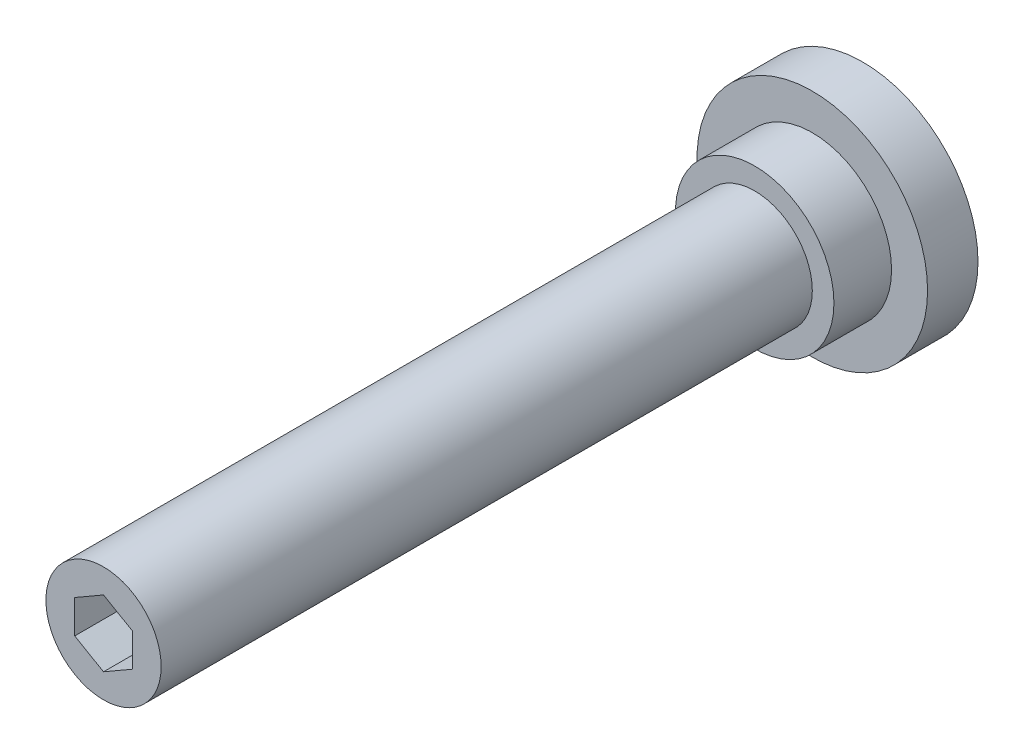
ISO-10303-21;
HEADER;
FILE_DESCRIPTION(('STEP AP214'),'2;1');
FILE_NAME('part.step','',(''),(''),'','','');
FILE_SCHEMA(('AUTOMOTIVE_DESIGN { 1 0 10303 214 1 1 1 1 }'));
ENDSEC;
DATA;
#1=APPLICATION_CONTEXT('core data for automotive mechanical design processes');
#2=APPLICATION_PROTOCOL_DEFINITION('international standard','automotive_design',2000,#1);
#3=PRODUCT_CONTEXT('',#1,'mechanical');
#4=PRODUCT('Part','Part','',(#3));
#5=PRODUCT_RELATED_PRODUCT_CATEGORY('part','',(#4));
#6=PRODUCT_DEFINITION_FORMATION('','',#4);
#7=PRODUCT_DEFINITION_CONTEXT('part definition',#1,'design');
#8=PRODUCT_DEFINITION('design','',#6,#7);
#9=PRODUCT_DEFINITION_SHAPE('','',#8);
#10=(LENGTH_UNIT() NAMED_UNIT(*) SI_UNIT(.MILLI.,.METRE.));
#11=(NAMED_UNIT(*) PLANE_ANGLE_UNIT() SI_UNIT($,.RADIAN.));
#12=(NAMED_UNIT(*) SI_UNIT($,.STERADIAN.) SOLID_ANGLE_UNIT());
#13=UNCERTAINTY_MEASURE_WITH_UNIT(LENGTH_MEASURE(1.E-05),#10,'distance_accuracy_value','');
#14=(GEOMETRIC_REPRESENTATION_CONTEXT(3) GLOBAL_UNCERTAINTY_ASSIGNED_CONTEXT((#13)) GLOBAL_UNIT_ASSIGNED_CONTEXT((#10,
#11,#12)) REPRESENTATION_CONTEXT('',''));
#15=CARTESIAN_POINT('',(0.,0.,0.));
#16=DIRECTION('',(0.,0.,1.));
#17=DIRECTION('',(1.,0.,0.));
#18=AXIS2_PLACEMENT_3D('',#15,#16,#17);
#19=CARTESIAN_POINT('',(0.,0.,105.4));
#20=DIRECTION('',(0.,0.,1.));
#21=DIRECTION('',(1.,0.,0.));
#22=AXIS2_PLACEMENT_3D('',#19,#20,#21);
#23=PLANE('',#22);
#24=DIRECTION('',(-0.866025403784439,0.5,0.));
#25=VECTOR('',#24,1.);
#26=CARTESIAN_POINT('',(4.,2.30940107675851,105.4));
#27=LINE('',#26,#25);
#28=CARTESIAN_POINT('',(4.,2.30940107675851,105.4));
#29=VERTEX_POINT('',#28);
#30=CARTESIAN_POINT('',(0.,4.61880215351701,105.4));
#31=VERTEX_POINT('',#30);
#32=EDGE_CURVE('E28',#29,#31,#27,.T.);
#33=ORIENTED_EDGE('',*,*,#32,.F.);
#34=DIRECTION('',(0.,1.,0.));
#35=VECTOR('',#34,1.);
#36=CARTESIAN_POINT('',(4.,-2.3094010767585,105.4));
#37=LINE('',#36,#35);
#38=CARTESIAN_POINT('',(4.,-2.3094010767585,105.4));
#39=VERTEX_POINT('',#38);
#40=EDGE_CURVE('E111',#39,#29,#37,.T.);
#41=ORIENTED_EDGE('',*,*,#40,.F.);
#42=DIRECTION('',(0.866025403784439,0.5,0.));
#43=VECTOR('',#42,1.);
#44=CARTESIAN_POINT('',(0.,-4.61880215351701,105.4));
#45=LINE('',#44,#43);
#46=CARTESIAN_POINT('',(0.,-4.61880215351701,105.4));
#47=VERTEX_POINT('',#46);
#48=EDGE_CURVE('E109',#47,#39,#45,.T.);
#49=ORIENTED_EDGE('',*,*,#48,.F.);
#50=DIRECTION('',(0.866025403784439,-0.5,0.));
#51=VECTOR('',#50,1.);
#52=CARTESIAN_POINT('',(-4.,-2.30940107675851,105.4));
#53=LINE('',#52,#51);
#54=CARTESIAN_POINT('',(-4.,-2.30940107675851,105.4));
#55=VERTEX_POINT('',#54);
#56=EDGE_CURVE('E76',#55,#47,#53,.T.);
#57=ORIENTED_EDGE('',*,*,#56,.F.);
#58=DIRECTION('',(0.,-1.,0.));
#59=VECTOR('',#58,1.);
#60=CARTESIAN_POINT('',(-4.,2.30940107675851,105.4));
#61=LINE('',#60,#59);
#62=CARTESIAN_POINT('',(-4.,2.30940107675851,105.4));
#63=VERTEX_POINT('',#62);
#64=EDGE_CURVE('E105',#63,#55,#61,.T.);
#65=ORIENTED_EDGE('',*,*,#64,.F.);
#66=DIRECTION('',(-0.866025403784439,-0.5,0.));
#67=VECTOR('',#66,1.);
#68=CARTESIAN_POINT('',(0.,4.61880215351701,105.4));
#69=LINE('',#68,#67);
#70=EDGE_CURVE('E102',#31,#63,#69,.T.);
#71=ORIENTED_EDGE('',*,*,#70,.F.);
#72=EDGE_LOOP('',(#33,#41,#49,#57,#65,#71));
#73=FACE_BOUND('',#72,.T.);
#74=CARTESIAN_POINT('',(0.,0.,105.4));
#75=DIRECTION('',(0.,0.,1.));
#76=DIRECTION('',(1.,0.,0.));
#77=AXIS2_PLACEMENT_3D('',#74,#75,#76);
#78=CIRCLE('',#77,8.);
#79=CARTESIAN_POINT('',(8.,0.,105.4));
#80=VERTEX_POINT('',#79);
#81=EDGE_CURVE('E9',#80,#80,#78,.T.);
#82=ORIENTED_EDGE('',*,*,#81,.T.);
#83=EDGE_LOOP('',(#82));
#84=FACE_BOUND('',#83,.T.);
#85=ADVANCED_FACE('F14',(#73,#84),#23,.T.);
#86=CARTESIAN_POINT('',(0.,0.,30.));
#87=DIRECTION('',(0.,0.,1.));
#88=DIRECTION('',(1.,0.,0.));
#89=AXIS2_PLACEMENT_3D('',#86,#87,#88);
#90=CYLINDRICAL_SURFACE('',#89,8.);
#91=CARTESIAN_POINT('',(0.,0.,15.));
#92=DIRECTION('',(0.,0.,1.));
#93=DIRECTION('',(1.,0.,0.));
#94=AXIS2_PLACEMENT_3D('',#91,#92,#93);
#95=CIRCLE('',#94,8.);
#96=CARTESIAN_POINT('',(8.,0.,15.));
#97=VERTEX_POINT('',#96);
#98=EDGE_CURVE('E21',#97,#97,#95,.T.);
#99=ORIENTED_EDGE('',*,*,#98,.T.);
#100=EDGE_LOOP('',(#99));
#101=FACE_BOUND('',#100,.T.);
#102=ORIENTED_EDGE('',*,*,#81,.F.);
#103=EDGE_LOOP('',(#102));
#104=FACE_BOUND('',#103,.T.);
#105=ADVANCED_FACE('F134',(#101,#104),#90,.T.);
#106=CARTESIAN_POINT('',(-8.,0.,15.));
#107=DIRECTION('',(0.,0.,1.));
#108=DIRECTION('',(1.,0.,0.));
#109=AXIS2_PLACEMENT_3D('',#106,#107,#108);
#110=PLANE('',#109);
#111=CARTESIAN_POINT('',(0.,0.,15.));
#112=DIRECTION('',(0.,0.,1.));
#113=DIRECTION('',(1.,0.,0.));
#114=AXIS2_PLACEMENT_3D('',#111,#112,#113);
#115=CIRCLE('',#114,11.);
#116=CARTESIAN_POINT('',(11.,0.,15.));
#117=VERTEX_POINT('',#116);
#118=EDGE_CURVE('E129',#117,#117,#115,.T.);
#119=ORIENTED_EDGE('',*,*,#118,.T.);
#120=EDGE_LOOP('',(#119));
#121=FACE_BOUND('',#120,.T.);
#122=ORIENTED_EDGE('',*,*,#98,.F.);
#123=EDGE_LOOP('',(#122));
#124=FACE_BOUND('',#123,.T.);
#125=ADVANCED_FACE('F137',(#121,#124),#110,.T.);
#126=CARTESIAN_POINT('',(0.,0.,30.));
#127=DIRECTION('',(0.,0.,1.));
#128=DIRECTION('',(1.,0.,0.));
#129=AXIS2_PLACEMENT_3D('',#126,#127,#128);
#130=CYLINDRICAL_SURFACE('',#129,11.);
#131=CARTESIAN_POINT('',(0.,0.,7.));
#132=DIRECTION('',(0.,0.,1.));
#133=DIRECTION('',(1.,0.,0.));
#134=AXIS2_PLACEMENT_3D('',#131,#132,#133);
#135=CIRCLE('',#134,11.);
#136=CARTESIAN_POINT('',(11.,0.,7.));
#137=VERTEX_POINT('',#136);
#138=EDGE_CURVE('E126',#137,#137,#135,.T.);
#139=ORIENTED_EDGE('',*,*,#138,.T.);
#140=EDGE_LOOP('',(#139));
#141=FACE_BOUND('',#140,.T.);
#142=ORIENTED_EDGE('',*,*,#118,.F.);
#143=EDGE_LOOP('',(#142));
#144=FACE_BOUND('',#143,.T.);
#145=ADVANCED_FACE('F139',(#141,#144),#130,.T.);
#146=CARTESIAN_POINT('',(-11.,0.,7.));
#147=DIRECTION('',(0.,0.,1.));
#148=DIRECTION('',(1.,0.,0.));
#149=AXIS2_PLACEMENT_3D('',#146,#147,#148);
#150=PLANE('',#149);
#151=CARTESIAN_POINT('',(0.,0.,7.));
#152=DIRECTION('',(0.,0.,1.));
#153=DIRECTION('',(1.,0.,0.));
#154=AXIS2_PLACEMENT_3D('',#151,#152,#153);
#155=CIRCLE('',#154,16.);
#156=CARTESIAN_POINT('',(16.,0.,7.));
#157=VERTEX_POINT('',#156);
#158=EDGE_CURVE('E123',#157,#157,#155,.T.);
#159=ORIENTED_EDGE('',*,*,#158,.T.);
#160=EDGE_LOOP('',(#159));
#161=FACE_BOUND('',#160,.T.);
#162=ORIENTED_EDGE('',*,*,#138,.F.);
#163=EDGE_LOOP('',(#162));
#164=FACE_BOUND('',#163,.T.);
#165=ADVANCED_FACE('F147',(#161,#164),#150,.T.);
#166=CARTESIAN_POINT('',(0.,0.,30.));
#167=DIRECTION('',(0.,0.,1.));
#168=DIRECTION('',(1.,0.,0.));
#169=AXIS2_PLACEMENT_3D('',#166,#167,#168);
#170=CYLINDRICAL_SURFACE('',#169,16.);
#171=CARTESIAN_POINT('',(0.,0.,0.));
#172=DIRECTION('',(0.,0.,1.));
#173=DIRECTION('',(1.,0.,0.));
#174=AXIS2_PLACEMENT_3D('',#171,#172,#173);
#175=CIRCLE('',#174,16.);
#176=CARTESIAN_POINT('',(16.,0.,0.));
#177=VERTEX_POINT('',#176);
#178=EDGE_CURVE('E115',#177,#177,#175,.T.);
#179=ORIENTED_EDGE('',*,*,#178,.T.);
#180=EDGE_LOOP('',(#179));
#181=FACE_BOUND('',#180,.T.);
#182=ORIENTED_EDGE('',*,*,#158,.F.);
#183=EDGE_LOOP('',(#182));
#184=FACE_BOUND('',#183,.T.);
#185=ADVANCED_FACE('F172',(#181,#184),#170,.T.);
#186=CARTESIAN_POINT('',(-16.,0.,0.));
#187=DIRECTION('',(0.,0.,-1.));
#188=DIRECTION('',(-1.,0.,0.));
#189=AXIS2_PLACEMENT_3D('',#186,#187,#188);
#190=PLANE('',#189);
#191=ORIENTED_EDGE('',*,*,#178,.F.);
#192=EDGE_LOOP('',(#191));
#193=FACE_BOUND('',#192,.T.);
#194=ADVANCED_FACE('F165',(#193),#190,.T.);
#195=CARTESIAN_POINT('',(4.,2.30940107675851,99.4));
#196=DIRECTION('',(0.5,0.866025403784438,0.));
#197=DIRECTION('',(-0.866025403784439,0.5,0.));
#198=AXIS2_PLACEMENT_3D('',#195,#196,#197);
#199=PLANE('',#198);
#200=ORIENTED_EDGE('',*,*,#32,.T.);
#201=DIRECTION('',(0.,0.,1.));
#202=VECTOR('',#201,1.);
#203=CARTESIAN_POINT('',(0.,4.61880215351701,99.4));
#204=LINE('',#203,#202);
#205=CARTESIAN_POINT('',(0.,4.61880215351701,99.4));
#206=VERTEX_POINT('',#205);
#207=EDGE_CURVE('E58',#206,#31,#204,.T.);
#208=ORIENTED_EDGE('',*,*,#207,.F.);
#209=DIRECTION('',(-0.866025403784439,0.5,0.));
#210=VECTOR('',#209,1.);
#211=CARTESIAN_POINT('',(4.,2.30940107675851,99.4));
#212=LINE('',#211,#210);
#213=CARTESIAN_POINT('',(4.,2.30940107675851,99.4));
#214=VERTEX_POINT('',#213);
#215=EDGE_CURVE('E113',#214,#206,#212,.T.);
#216=ORIENTED_EDGE('',*,*,#215,.F.);
#217=DIRECTION('',(0.,0.,1.));
#218=VECTOR('',#217,1.);
#219=CARTESIAN_POINT('',(4.,2.30940107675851,99.4));
#220=LINE('',#219,#218);
#221=EDGE_CURVE('E36',#214,#29,#220,.T.);
#222=ORIENTED_EDGE('',*,*,#221,.T.);
#223=EDGE_LOOP('',(#200,#208,#216,#222));
#224=FACE_BOUND('',#223,.T.);
#225=ADVANCED_FACE('F162',(#224),#199,.F.);
#226=CARTESIAN_POINT('',(4.,-2.3094010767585,99.4));
#227=DIRECTION('',(1.,0.,0.));
#228=DIRECTION('',(0.,0.,-1.));
#229=AXIS2_PLACEMENT_3D('',#226,#227,#228);
#230=PLANE('',#229);
#231=ORIENTED_EDGE('',*,*,#40,.T.);
#232=ORIENTED_EDGE('',*,*,#221,.F.);
#233=DIRECTION('',(0.,1.,0.));
#234=VECTOR('',#233,1.);
#235=CARTESIAN_POINT('',(4.,-2.3094010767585,99.4));
#236=LINE('',#235,#234);
#237=CARTESIAN_POINT('',(4.,-2.3094010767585,99.4));
#238=VERTEX_POINT('',#237);
#239=EDGE_CURVE('E88',#238,#214,#236,.T.);
#240=ORIENTED_EDGE('',*,*,#239,.F.);
#241=DIRECTION('',(0.,0.,1.));
#242=VECTOR('',#241,1.);
#243=CARTESIAN_POINT('',(4.,-2.3094010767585,99.4));
#244=LINE('',#243,#242);
#245=EDGE_CURVE('E80',#238,#39,#244,.T.);
#246=ORIENTED_EDGE('',*,*,#245,.T.);
#247=EDGE_LOOP('',(#231,#232,#240,#246));
#248=FACE_BOUND('',#247,.T.);
#249=ADVANCED_FACE('F164',(#248),#230,.F.);
#250=CARTESIAN_POINT('',(0.,-4.61880215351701,99.4));
#251=DIRECTION('',(0.5,-0.866025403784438,0.));
#252=DIRECTION('',(0.866025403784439,0.5,0.));
#253=AXIS2_PLACEMENT_3D('',#250,#251,#252);
#254=PLANE('',#253);
#255=ORIENTED_EDGE('',*,*,#48,.T.);
#256=ORIENTED_EDGE('',*,*,#245,.F.);
#257=DIRECTION('',(0.866025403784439,0.5,0.));
#258=VECTOR('',#257,1.);
#259=CARTESIAN_POINT('',(0.,-4.61880215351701,99.4));
#260=LINE('',#259,#258);
#261=CARTESIAN_POINT('',(0.,-4.61880215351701,99.4));
#262=VERTEX_POINT('',#261);
#263=EDGE_CURVE('E84',#262,#238,#260,.T.);
#264=ORIENTED_EDGE('',*,*,#263,.F.);
#265=DIRECTION('',(0.,0.,1.));
#266=VECTOR('',#265,1.);
#267=CARTESIAN_POINT('',(0.,-4.61880215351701,99.4));
#268=LINE('',#267,#266);
#269=EDGE_CURVE('E69',#262,#47,#268,.T.);
#270=ORIENTED_EDGE('',*,*,#269,.T.);
#271=EDGE_LOOP('',(#255,#256,#264,#270));
#272=FACE_BOUND('',#271,.T.);
#273=ADVANCED_FACE('F85',(#272),#254,.F.);
#274=CARTESIAN_POINT('',(-4.,-2.30940107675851,99.4));
#275=DIRECTION('',(-0.5,-0.866025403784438,0.));
#276=DIRECTION('',(0.866025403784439,-0.5,0.));
#277=AXIS2_PLACEMENT_3D('',#274,#275,#276);
#278=PLANE('',#277);
#279=ORIENTED_EDGE('',*,*,#56,.T.);
#280=ORIENTED_EDGE('',*,*,#269,.F.);
#281=DIRECTION('',(0.866025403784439,-0.5,0.));
#282=VECTOR('',#281,1.);
#283=CARTESIAN_POINT('',(-4.,-2.30940107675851,99.4));
#284=LINE('',#283,#282);
#285=CARTESIAN_POINT('',(-4.,-2.30940107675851,99.4));
#286=VERTEX_POINT('',#285);
#287=EDGE_CURVE('E73',#286,#262,#284,.T.);
#288=ORIENTED_EDGE('',*,*,#287,.F.);
#289=DIRECTION('',(0.,0.,1.));
#290=VECTOR('',#289,1.);
#291=CARTESIAN_POINT('',(-4.,-2.30940107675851,99.4));
#292=LINE('',#291,#290);
#293=EDGE_CURVE('E81',#286,#55,#292,.T.);
#294=ORIENTED_EDGE('',*,*,#293,.T.);
#295=EDGE_LOOP('',(#279,#280,#288,#294));
#296=FACE_BOUND('',#295,.T.);
#297=ADVANCED_FACE('F71',(#296),#278,.F.);
#298=CARTESIAN_POINT('',(-4.,2.30940107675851,99.4));
#299=DIRECTION('',(-1.,0.,0.));
#300=DIRECTION('',(0.,-1.,0.));
#301=AXIS2_PLACEMENT_3D('',#298,#299,#300);
#302=PLANE('',#301);
#303=ORIENTED_EDGE('',*,*,#64,.T.);
#304=ORIENTED_EDGE('',*,*,#293,.F.);
#305=DIRECTION('',(0.,-1.,0.));
#306=VECTOR('',#305,1.);
#307=CARTESIAN_POINT('',(-4.,2.30940107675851,99.4));
#308=LINE('',#307,#306);
#309=CARTESIAN_POINT('',(-4.,2.30940107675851,99.4));
#310=VERTEX_POINT('',#309);
#311=EDGE_CURVE('E94',#310,#286,#308,.T.);
#312=ORIENTED_EDGE('',*,*,#311,.F.);
#313=DIRECTION('',(0.,0.,1.));
#314=VECTOR('',#313,1.);
#315=CARTESIAN_POINT('',(-4.,2.30940107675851,99.4));
#316=LINE('',#315,#314);
#317=EDGE_CURVE('E118',#310,#63,#316,.T.);
#318=ORIENTED_EDGE('',*,*,#317,.T.);
#319=EDGE_LOOP('',(#303,#304,#312,#318));
#320=FACE_BOUND('',#319,.T.);
#321=ADVANCED_FACE('F237',(#320),#302,.F.);
#322=CARTESIAN_POINT('',(0.,4.61880215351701,99.4));
#323=DIRECTION('',(-0.5,0.866025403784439,0.));
#324=DIRECTION('',(-0.866025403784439,-0.5,0.));
#325=AXIS2_PLACEMENT_3D('',#322,#323,#324);
#326=PLANE('',#325);
#327=ORIENTED_EDGE('',*,*,#70,.T.);
#328=ORIENTED_EDGE('',*,*,#317,.F.);
#329=DIRECTION('',(-0.866025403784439,-0.5,0.));
#330=VECTOR('',#329,1.);
#331=CARTESIAN_POINT('',(0.,4.61880215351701,99.4));
#332=LINE('',#331,#330);
#333=EDGE_CURVE('E96',#206,#310,#332,.T.);
#334=ORIENTED_EDGE('',*,*,#333,.F.);
#335=ORIENTED_EDGE('',*,*,#207,.T.);
#336=EDGE_LOOP('',(#327,#328,#334,#335));
#337=FACE_BOUND('',#336,.T.);
#338=ADVANCED_FACE('F160',(#337),#326,.F.);
#339=CARTESIAN_POINT('',(0.,4.61880215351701,99.4));
#340=DIRECTION('',(0.,0.,1.));
#341=DIRECTION('',(1.,0.,0.));
#342=AXIS2_PLACEMENT_3D('',#339,#340,#341);
#343=PLANE('',#342);
#344=ORIENTED_EDGE('',*,*,#215,.T.);
#345=ORIENTED_EDGE('',*,*,#333,.T.);
#346=ORIENTED_EDGE('',*,*,#311,.T.);
#347=ORIENTED_EDGE('',*,*,#287,.T.);
#348=ORIENTED_EDGE('',*,*,#263,.T.);
#349=ORIENTED_EDGE('',*,*,#239,.T.);
#350=EDGE_LOOP('',(#344,#345,#346,#347,#348,#349));
#351=FACE_BOUND('',#350,.T.);
#352=ADVANCED_FACE('F91',(#351),#343,.T.);
#353=CLOSED_SHELL('',(#85,#105,#125,#145,#165,#185,#194,#225,#249,#273,#297,#321,#338,#352));
#354=MANIFOLD_SOLID_BREP('B1',#353);
#355=ADVANCED_BREP_SHAPE_REPRESENTATION('',(#18,#354),#14);
#356=SHAPE_DEFINITION_REPRESENTATION(#9,#355);
ENDSEC;
END-ISO-10303-21;
